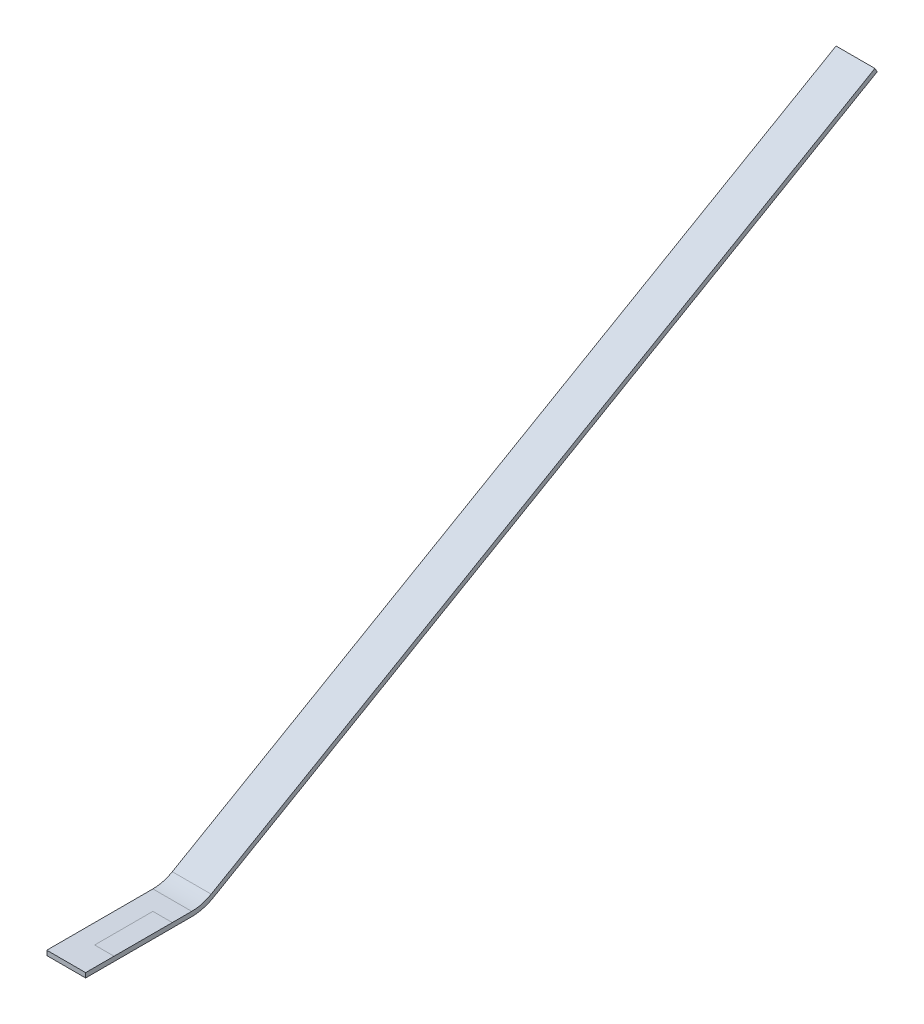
from build123d import *

# Parameters (mm, degrees)
EXTRUDE_THIN1_DEPTH = 6.35


with BuildPart() as part:
    # Sketch1 → Extrude-Thin1 (new, symmetric)
    with BuildSketch(Plane(origin=(0, 0, 0), x_dir=(0, 0, -1), z_dir=(1, 0, 0))):
        with BuildLine():
            Line((-38.1, 0), (-3.402954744, 0))
            ThreePointArc((-3.402954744, 0), (-0.115952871, 0.432742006), (2.947045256, 1.701477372))
            Line((2.947045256, 1.701477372), (219.970452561, 127))
            Line((219.970452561, 127), (220.732452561, 125.680177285))
            Line((220.732452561, 125.680177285), (3.709045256, 0.381654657))
            ThreePointArc((3.709045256, 0.381654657), (0.278487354, -1.039328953), (-3.402954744, -1.524))
            Line((-3.402954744, -1.524), (-38.1, -1.524))
            Line((-38.1, -1.524), (-38.1, 0))
        make_face()
    extrude(amount=EXTRUDE_THIN1_DEPTH, both=True)


solid = part.part
